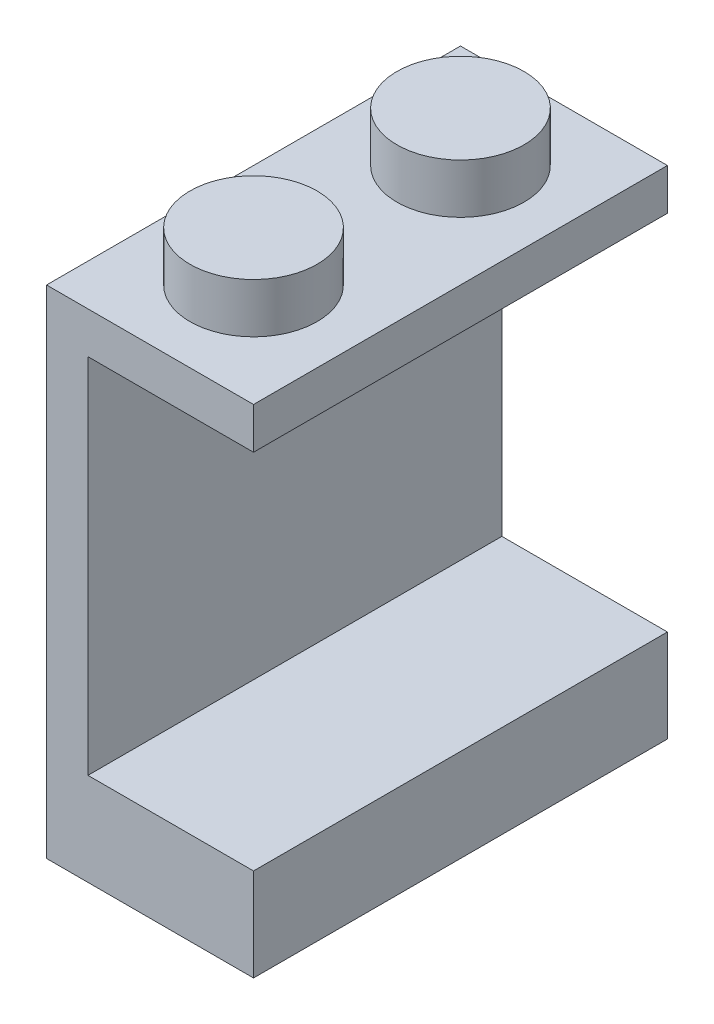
from build123d import *

# Parameters (mm, degrees)
SKETCH1_W           = 7.9375
SKETCH1_H           = 15.875
BASE_EXTRUDE_DEPTH  = 19.05
SKETCH2_R           = 2.4384
BOSS_EXTRUDE1_DEPTH = 1.905
LPATTERN6_COUNT     = 2
LPATTERN6_PITCH     = 7.9375
SKETCH4_W           = 4.7625
SKETCH4_H           = 12.7
CUT_EXTRUDE1_DEPTH  = 1.5875
INSDOT_REACH        = 24.757
SKETCH3_R           = 2.032
SKETCH3_R_2         = 1.27
SKETCH5_W           = 6.35
SKETCH5_H           = 13.9065
CUT_EXTRUDE2_DEPTH  = 27.587189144


with BuildPart() as part:
    # Sketch1 → Base-Extrude (new body)
    with BuildSketch(Plane(origin=(0, 0, 0), x_dir=(1, 0, 0), z_dir=(0, 1, 0))):
        Rectangle(SKETCH1_W, SKETCH1_H)
    extrude(amount=BASE_EXTRUDE_DEPTH)

    # Sketch2 → Boss-Extrude1 (add)
    with BuildSketch(Plane(origin=(0, 19.05, 0), x_dir=(-1, 0, 0), z_dir=(0, 1, 0))):
        with Locations(Location((0, 3.96875, 0), (0, 0, 270))):
            Circle(SKETCH2_R)
    boss_extrude1 = extrude(amount=BOSS_EXTRUDE1_DEPTH)

    # LPattern6: Boss-Extrude1 ×2
    with Locations(*[(0, 0, -i * LPATTERN6_PITCH) for i in range(1, LPATTERN6_COUNT)]):
        add(boss_extrude1)

    # Sketch4 → Cut-Extrude1 (cut)
    with BuildSketch(Plane.XZ):
        Rectangle(SKETCH4_W, SKETCH4_H)
    extrude(amount=-CUT_EXTRUDE1_DEPTH, mode=Mode.SUBTRACT)

    # Sketch3 → InsDot (add, up to next)
    with BuildSketch(Plane.XZ, mode=Mode.PRIVATE) as insdot_sk1:
        Circle(SKETCH3_R)
        Circle(SKETCH3_R_2, mode=Mode.SUBTRACT)
    insdot_tool1 = extrude(insdot_sk1.sketch, amount=-INSDOT_REACH, mode=Mode.PRIVATE) - part.part
    add(insdot_tool1.solids().sort_by_distance((-1.974526, 0, 0))[0])

    # Sketch5 → Cut-Extrude2 (cut, through all)
    with BuildSketch(Plane.XY.offset(7.9375)):
        with Locations((0.79375, 10.50925)):
            Rectangle(SKETCH5_W, SKETCH5_H)
    extrude(amount=-CUT_EXTRUDE2_DEPTH, mode=Mode.SUBTRACT)


solid = part.part
